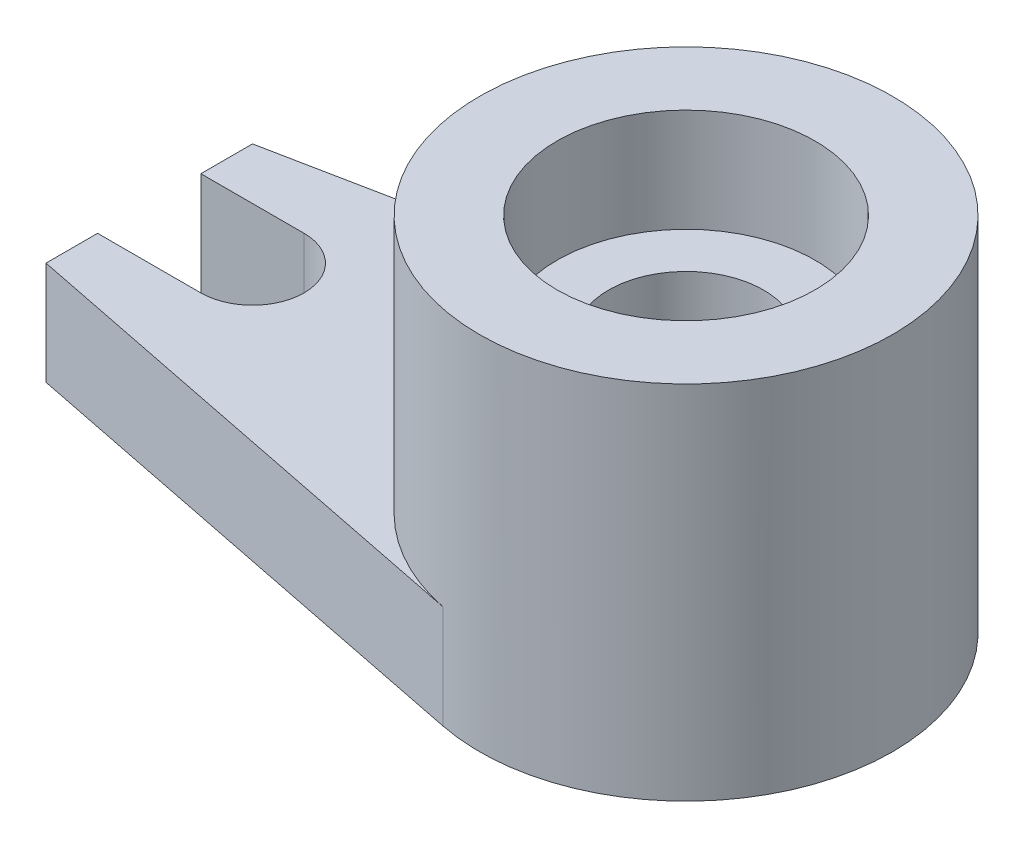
from build123d import *

# Parameters (mm, degrees)
SKETCH_1_R      = 20
SKETCH_1_R_2    = 12.5
EXTRUDE_1_DEPTH = 35
SKETCH_1_4_R    = 12.5
SKETCH_1_4_R_2  = 7.5
EXTRUDE_2_DEPTH = 25
EXTRUDE_3_DEPTH = 10


with BuildPart() as part:
    # Sketch 1 → Extrude 1 (new body)
    with BuildSketch(Plane(origin=(0, 0, 0), x_dir=(1, 0, 0), z_dir=(0, 1, 0))):
        with Locations(Location((0, 0, 0), (0, 0, 270))):
            Circle(SKETCH_1_R)
        with Locations(Location((0, 0, 0), (0, 0, 270))):
            Circle(SKETCH_1_R_2, mode=Mode.SUBTRACT)
    extrude(amount=EXTRUDE_1_DEPTH)

    # Sketch 1_4 → Extrude 2 (add)
    with BuildSketch(Plane(origin=(0, 0, 0), x_dir=(1, 0, 0), z_dir=(0, 1, 0))):
        with Locations(Location((0, 0, 0), (0, 0, 270))):
            Circle(SKETCH_1_4_R)
        with Locations(Location((0, 0, 0), (0, 0, 270))):
            Circle(SKETCH_1_4_R_2, mode=Mode.SUBTRACT)
    extrude(amount=EXTRUDE_2_DEPTH)

    # Sketch 1_5 → Extrude 3 (add)
    with BuildSketch(Plane(origin=(0, 0, 0), x_dir=(1, 0, 0), z_dir=(0, 1, 0))):
        with BuildLine():
            ThreePointArc((-3.920784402, -19.611921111), (-20, 0), (-3.920784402, 19.611921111))
            Line((-3.920784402, 19.611921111), (-52, 10))
            Line((-52, 10), (-52, 5))
            Line((-52, 5), (-42, 5))
            ThreePointArc((-42, 5), (-37, 0), (-42, -5))
            Line((-42, -5), (-52, -5))
            Line((-52, -5), (-52, -10))
            Line((-52, -10), (-3.920784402, -19.611921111))
        make_face()
    extrude(amount=EXTRUDE_3_DEPTH)


solid = part.part
